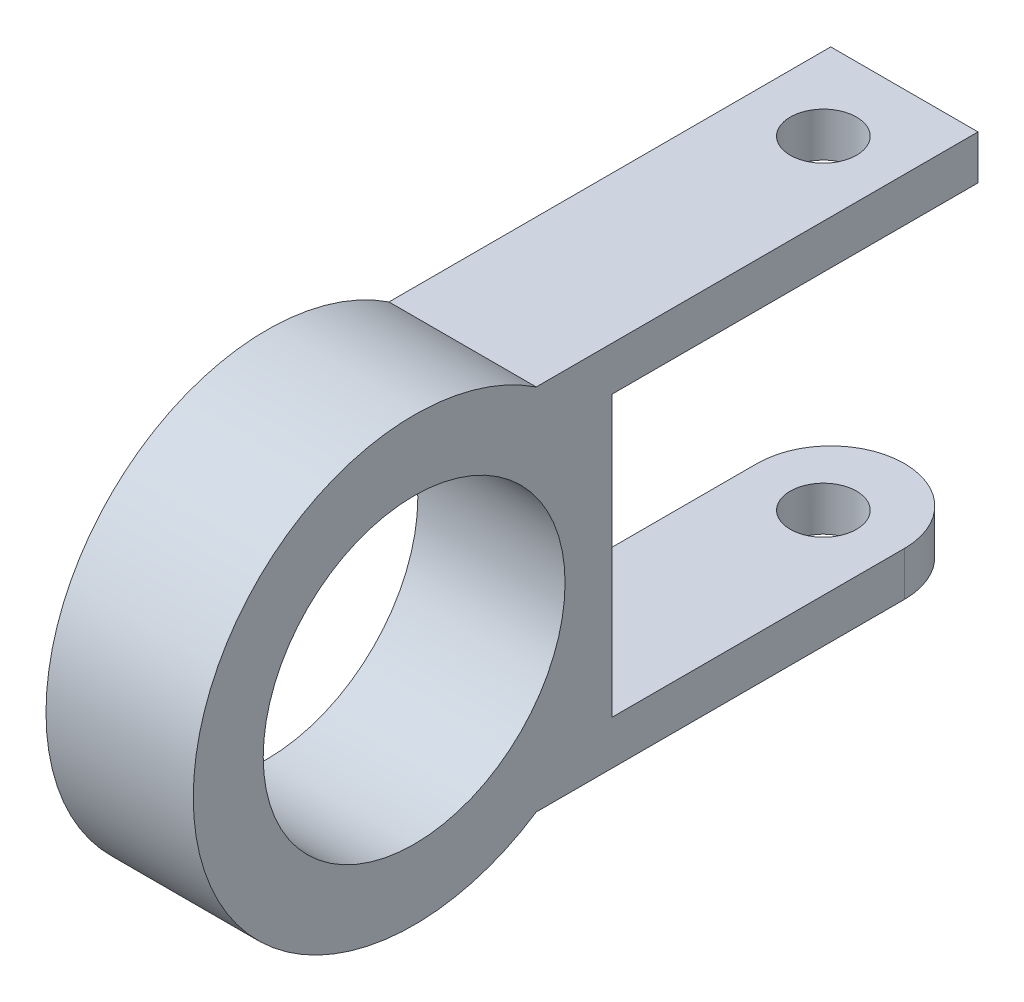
ISO-10303-21;
HEADER;
FILE_DESCRIPTION(('STEP AP214'),'2;1');
FILE_NAME('part.step','',(''),(''),'','','');
FILE_SCHEMA(('AUTOMOTIVE_DESIGN { 1 0 10303 214 1 1 1 1 }'));
ENDSEC;
DATA;
#1=APPLICATION_CONTEXT('core data for automotive mechanical design processes');
#2=APPLICATION_PROTOCOL_DEFINITION('international standard','automotive_design',2000,#1);
#3=PRODUCT_CONTEXT('',#1,'mechanical');
#4=PRODUCT('Part','Part','',(#3));
#5=PRODUCT_RELATED_PRODUCT_CATEGORY('part','',(#4));
#6=PRODUCT_DEFINITION_FORMATION('','',#4);
#7=PRODUCT_DEFINITION_CONTEXT('part definition',#1,'design');
#8=PRODUCT_DEFINITION('design','',#6,#7);
#9=PRODUCT_DEFINITION_SHAPE('','',#8);
#10=(LENGTH_UNIT() NAMED_UNIT(*) SI_UNIT(.MILLI.,.METRE.));
#11=(NAMED_UNIT(*) PLANE_ANGLE_UNIT() SI_UNIT($,.RADIAN.));
#12=(NAMED_UNIT(*) SI_UNIT($,.STERADIAN.) SOLID_ANGLE_UNIT());
#13=UNCERTAINTY_MEASURE_WITH_UNIT(LENGTH_MEASURE(1.E-05),#10,'distance_accuracy_value','');
#14=(GEOMETRIC_REPRESENTATION_CONTEXT(3) GLOBAL_UNCERTAINTY_ASSIGNED_CONTEXT((#13)) GLOBAL_UNIT_ASSIGNED_CONTEXT((#10,
#11,#12)) REPRESENTATION_CONTEXT('',''));
#15=CARTESIAN_POINT('',(0.,0.,0.));
#16=DIRECTION('',(0.,0.,1.));
#17=DIRECTION('',(1.,0.,0.));
#18=AXIS2_PLACEMENT_3D('',#15,#16,#17);
#19=CARTESIAN_POINT('',(5.,-9.5,-33.2915619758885));
#20=DIRECTION('',(0.,1.,0.));
#21=DIRECTION('',(0.,0.,1.));
#22=AXIS2_PLACEMENT_3D('',#19,#20,#21);
#23=CYLINDRICAL_SURFACE('',#22,5.);
#24=DIRECTION('',(0.,1.,0.));
#25=VECTOR('',#24,1.);
#26=CARTESIAN_POINT('',(0.,0.,-33.2915619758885));
#27=LINE('',#26,#25);
#28=CARTESIAN_POINT('',(0.,-9.5,-33.2915619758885));
#29=VERTEX_POINT('',#28);
#30=CARTESIAN_POINT('',(0.,-12.5,-33.2915619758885));
#31=VERTEX_POINT('',#30);
#32=EDGE_CURVE('E202',#29,#31,#27,.F.);
#33=ORIENTED_EDGE('',*,*,#32,.F.);
#34=CARTESIAN_POINT('',(5.,-9.5,-33.2915619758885));
#35=DIRECTION('',(0.,-1.,0.));
#36=DIRECTION('',(0.,0.,-1.));
#37=AXIS2_PLACEMENT_3D('',#34,#35,#36);
#38=CIRCLE('',#37,5.);
#39=CARTESIAN_POINT('',(10.,-9.5,-33.2915619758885));
#40=VERTEX_POINT('',#39);
#41=EDGE_CURVE('E54',#40,#29,#38,.F.);
#42=ORIENTED_EDGE('',*,*,#41,.F.);
#43=DIRECTION('',(0.,-1.,0.));
#44=VECTOR('',#43,1.);
#45=CARTESIAN_POINT('',(10.,-9.5,-33.2915619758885));
#46=LINE('',#45,#44);
#47=CARTESIAN_POINT('',(10.,-12.5,-33.2915619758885));
#48=VERTEX_POINT('',#47);
#49=EDGE_CURVE('E134',#48,#40,#46,.F.);
#50=ORIENTED_EDGE('',*,*,#49,.F.);
#51=CARTESIAN_POINT('',(5.,-12.5,-33.2915619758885));
#52=DIRECTION('',(0.,1.,0.));
#53=DIRECTION('',(0.,0.,1.));
#54=AXIS2_PLACEMENT_3D('',#51,#52,#53);
#55=CIRCLE('',#54,5.);
#56=EDGE_CURVE('E11',#31,#48,#55,.F.);
#57=ORIENTED_EDGE('',*,*,#56,.F.);
#58=EDGE_LOOP('',(#33,#42,#50,#57));
#59=FACE_BOUND('',#58,.T.);
#60=ADVANCED_FACE('F45',(#59),#23,.T.);
#61=CARTESIAN_POINT('',(10.,0.,-38.2915619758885));
#62=DIRECTION('',(0.,0.,1.));
#63=DIRECTION('',(1.,0.,0.));
#64=AXIS2_PLACEMENT_3D('',#61,#62,#63);
#65=PLANE('',#64);
#66=DIRECTION('',(0.,1.,0.));
#67=VECTOR('',#66,1.);
#68=CARTESIAN_POINT('',(10.,0.,-38.2915619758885));
#69=LINE('',#68,#67);
#70=CARTESIAN_POINT('',(10.,9.5,-38.2915619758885));
#71=VERTEX_POINT('',#70);
#72=CARTESIAN_POINT('',(10.,12.5,-38.2915619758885));
#73=VERTEX_POINT('',#72);
#74=EDGE_CURVE('E152',#71,#73,#69,.T.);
#75=ORIENTED_EDGE('',*,*,#74,.F.);
#76=DIRECTION('',(-1.,0.,0.));
#77=VECTOR('',#76,1.);
#78=CARTESIAN_POINT('',(10.,9.5,-38.2915619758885));
#79=LINE('',#78,#77);
#80=CARTESIAN_POINT('',(0.,9.5,-38.2915619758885));
#81=VERTEX_POINT('',#80);
#82=EDGE_CURVE('E143',#71,#81,#79,.T.);
#83=ORIENTED_EDGE('',*,*,#82,.T.);
#84=DIRECTION('',(0.,1.,0.));
#85=VECTOR('',#84,1.);
#86=CARTESIAN_POINT('',(0.,0.,-38.2915619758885));
#87=LINE('',#86,#85);
#88=CARTESIAN_POINT('',(0.,12.5,-38.2915619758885));
#89=VERTEX_POINT('',#88);
#90=EDGE_CURVE('E170',#81,#89,#87,.T.);
#91=ORIENTED_EDGE('',*,*,#90,.T.);
#92=DIRECTION('',(-1.,0.,0.));
#93=VECTOR('',#92,1.);
#94=CARTESIAN_POINT('',(10.,12.5,-38.2915619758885));
#95=LINE('',#94,#93);
#96=EDGE_CURVE('E189',#73,#89,#95,.T.);
#97=ORIENTED_EDGE('',*,*,#96,.F.);
#98=EDGE_LOOP('',(#75,#83,#91,#97));
#99=FACE_BOUND('',#98,.T.);
#100=ADVANCED_FACE('F225',(#99),#65,.F.);
#101=CARTESIAN_POINT('',(10.,0.,0.));
#102=DIRECTION('',(-1.,0.,0.));
#103=DIRECTION('',(0.,0.,1.));
#104=AXIS2_PLACEMENT_3D('',#101,#102,#103);
#105=CYLINDRICAL_SURFACE('',#104,10.25);
#106=CARTESIAN_POINT('',(0.,0.,0.));
#107=DIRECTION('',(1.,0.,0.));
#108=DIRECTION('',(0.,0.,-1.));
#109=AXIS2_PLACEMENT_3D('',#106,#107,#108);
#110=CIRCLE('',#109,10.25);
#111=CARTESIAN_POINT('',(0.,0.,-10.25));
#112=VERTEX_POINT('',#111);
#113=EDGE_CURVE('E153',#112,#112,#110,.T.);
#114=ORIENTED_EDGE('',*,*,#113,.F.);
#115=EDGE_LOOP('',(#114));
#116=FACE_BOUND('',#115,.T.);
#117=CARTESIAN_POINT('',(10.,0.,0.));
#118=DIRECTION('',(1.,0.,0.));
#119=DIRECTION('',(0.,0.,-1.));
#120=AXIS2_PLACEMENT_3D('',#117,#118,#119);
#121=CIRCLE('',#120,10.25);
#122=CARTESIAN_POINT('',(10.,0.,-10.25));
#123=VERTEX_POINT('',#122);
#124=EDGE_CURVE('E163',#123,#123,#121,.T.);
#125=ORIENTED_EDGE('',*,*,#124,.T.);
#126=EDGE_LOOP('',(#125));
#127=FACE_BOUND('',#126,.T.);
#128=ADVANCED_FACE('F236',(#116,#127),#105,.F.);
#129=CARTESIAN_POINT('',(10.,-12.5,0.));
#130=DIRECTION('',(0.,1.,0.));
#131=DIRECTION('',(0.,0.,1.));
#132=AXIS2_PLACEMENT_3D('',#129,#130,#131);
#133=PLANE('',#132);
#134=CARTESIAN_POINT('',(5.,-12.5,-32.7915619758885));
#135=DIRECTION('',(0.,1.,0.));
#136=DIRECTION('',(0.,0.,1.));
#137=AXIS2_PLACEMENT_3D('',#134,#135,#136);
#138=CIRCLE('',#137,2.25);
#139=CARTESIAN_POINT('',(5.,-12.5,-30.5415619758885));
#140=VERTEX_POINT('',#139);
#141=EDGE_CURVE('E130',#140,#140,#138,.F.);
#142=ORIENTED_EDGE('',*,*,#141,.F.);
#143=EDGE_LOOP('',(#142));
#144=FACE_BOUND('',#143,.T.);
#145=DIRECTION('',(0.,0.,-1.));
#146=VECTOR('',#145,1.);
#147=CARTESIAN_POINT('',(0.,-12.5,0.));
#148=LINE('',#147,#146);
#149=CARTESIAN_POINT('',(0.,-12.5,-8.2915619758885));
#150=VERTEX_POINT('',#149);
#151=EDGE_CURVE('E148',#150,#31,#148,.T.);
#152=ORIENTED_EDGE('',*,*,#151,.T.);
#153=ORIENTED_EDGE('',*,*,#56,.T.);
#154=DIRECTION('',(0.,0.,-1.));
#155=VECTOR('',#154,1.);
#156=CARTESIAN_POINT('',(10.,-12.5,0.));
#157=LINE('',#156,#155);
#158=CARTESIAN_POINT('',(10.,-12.5,-8.2915619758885));
#159=VERTEX_POINT('',#158);
#160=EDGE_CURVE('E149',#159,#48,#157,.T.);
#161=ORIENTED_EDGE('',*,*,#160,.F.);
#162=DIRECTION('',(-1.,0.,0.));
#163=VECTOR('',#162,1.);
#164=CARTESIAN_POINT('',(10.,-12.5,-8.2915619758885));
#165=LINE('',#164,#163);
#166=EDGE_CURVE('E167',#159,#150,#165,.T.);
#167=ORIENTED_EDGE('',*,*,#166,.T.);
#168=EDGE_LOOP('',(#152,#153,#161,#167));
#169=FACE_BOUND('',#168,.T.);
#170=ADVANCED_FACE('F234',(#144,#169),#133,.F.);
#171=CARTESIAN_POINT('',(10.,12.5,0.));
#172=DIRECTION('',(0.,1.,0.));
#173=DIRECTION('',(0.,0.,1.));
#174=AXIS2_PLACEMENT_3D('',#171,#172,#173);
#175=PLANE('',#174);
#176=CARTESIAN_POINT('',(5.,12.5,-32.7915619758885));
#177=DIRECTION('',(0.,1.,0.));
#178=DIRECTION('',(0.,0.,1.));
#179=AXIS2_PLACEMENT_3D('',#176,#177,#178);
#180=CIRCLE('',#179,2.25);
#181=CARTESIAN_POINT('',(5.,12.5,-30.5415619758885));
#182=VERTEX_POINT('',#181);
#183=EDGE_CURVE('E283',#182,#182,#180,.F.);
#184=ORIENTED_EDGE('',*,*,#183,.T.);
#185=EDGE_LOOP('',(#184));
#186=FACE_BOUND('',#185,.T.);
#187=DIRECTION('',(0.,0.,-1.));
#188=VECTOR('',#187,1.);
#189=CARTESIAN_POINT('',(0.,12.5,0.));
#190=LINE('',#189,#188);
#191=CARTESIAN_POINT('',(0.,12.5,-8.2915619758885));
#192=VERTEX_POINT('',#191);
#193=EDGE_CURVE('E173',#192,#89,#190,.T.);
#194=ORIENTED_EDGE('',*,*,#193,.F.);
#195=DIRECTION('',(-1.,0.,0.));
#196=VECTOR('',#195,1.);
#197=CARTESIAN_POINT('',(10.,12.5,-8.2915619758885));
#198=LINE('',#197,#196);
#199=CARTESIAN_POINT('',(10.,12.5,-8.2915619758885));
#200=VERTEX_POINT('',#199);
#201=EDGE_CURVE('E186',#200,#192,#198,.T.);
#202=ORIENTED_EDGE('',*,*,#201,.F.);
#203=DIRECTION('',(0.,0.,-1.));
#204=VECTOR('',#203,1.);
#205=CARTESIAN_POINT('',(10.,12.5,0.));
#206=LINE('',#205,#204);
#207=EDGE_CURVE('E156',#200,#73,#206,.T.);
#208=ORIENTED_EDGE('',*,*,#207,.T.);
#209=ORIENTED_EDGE('',*,*,#96,.T.);
#210=EDGE_LOOP('',(#194,#202,#208,#209));
#211=FACE_BOUND('',#210,.T.);
#212=ADVANCED_FACE('F228',(#186,#211),#175,.T.);
#213=CARTESIAN_POINT('',(10.,0.,0.));
#214=DIRECTION('',(-1.,0.,0.));
#215=DIRECTION('',(0.,0.,1.));
#216=AXIS2_PLACEMENT_3D('',#213,#214,#215);
#217=CYLINDRICAL_SURFACE('',#216,15.);
#218=CARTESIAN_POINT('',(0.,0.,0.));
#219=DIRECTION('',(1.,0.,0.));
#220=DIRECTION('',(0.,0.,-1.));
#221=AXIS2_PLACEMENT_3D('',#218,#219,#220);
#222=CIRCLE('',#221,15.);
#223=EDGE_CURVE('E177',#192,#150,#222,.T.);
#224=ORIENTED_EDGE('',*,*,#223,.T.);
#225=ORIENTED_EDGE('',*,*,#166,.F.);
#226=CARTESIAN_POINT('',(10.,0.,0.));
#227=DIRECTION('',(1.,0.,0.));
#228=DIRECTION('',(0.,0.,-1.));
#229=AXIS2_PLACEMENT_3D('',#226,#227,#228);
#230=CIRCLE('',#229,15.);
#231=EDGE_CURVE('E160',#200,#159,#230,.T.);
#232=ORIENTED_EDGE('',*,*,#231,.F.);
#233=ORIENTED_EDGE('',*,*,#201,.T.);
#234=EDGE_LOOP('',(#224,#225,#232,#233));
#235=FACE_BOUND('',#234,.T.);
#236=ADVANCED_FACE('F232',(#235),#217,.T.);
#237=CARTESIAN_POINT('',(10.,0.,0.));
#238=DIRECTION('',(1.,0.,0.));
#239=DIRECTION('',(0.,0.,-1.));
#240=AXIS2_PLACEMENT_3D('',#237,#238,#239);
#241=PLANE('',#240);
#242=ORIENTED_EDGE('',*,*,#124,.F.);
#243=EDGE_LOOP('',(#242));
#244=FACE_BOUND('',#243,.T.);
#245=ORIENTED_EDGE('',*,*,#160,.T.);
#246=ORIENTED_EDGE('',*,*,#49,.T.);
#247=DIRECTION('',(0.,0.,-1.));
#248=VECTOR('',#247,1.);
#249=CARTESIAN_POINT('',(10.,-9.5,-13.447806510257));
#250=LINE('',#249,#248);
#251=CARTESIAN_POINT('',(10.,-9.5,-13.447806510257));
#252=VERTEX_POINT('',#251);
#253=EDGE_CURVE('E113',#252,#40,#250,.T.);
#254=ORIENTED_EDGE('',*,*,#253,.F.);
#255=DIRECTION('',(0.,-1.,0.));
#256=VECTOR('',#255,1.);
#257=CARTESIAN_POINT('',(10.,9.5,-13.447806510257));
#258=LINE('',#257,#256);
#259=CARTESIAN_POINT('',(10.,9.5,-13.447806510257));
#260=VERTEX_POINT('',#259);
#261=EDGE_CURVE('E123',#260,#252,#258,.T.);
#262=ORIENTED_EDGE('',*,*,#261,.F.);
#263=DIRECTION('',(0.,0.,1.));
#264=VECTOR('',#263,1.);
#265=CARTESIAN_POINT('',(10.,9.5,-13.447806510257));
#266=LINE('',#265,#264);
#267=EDGE_CURVE('E120',#71,#260,#266,.T.);
#268=ORIENTED_EDGE('',*,*,#267,.F.);
#269=ORIENTED_EDGE('',*,*,#74,.T.);
#270=ORIENTED_EDGE('',*,*,#207,.F.);
#271=ORIENTED_EDGE('',*,*,#231,.T.);
#272=EDGE_LOOP('',(#245,#246,#254,#262,#268,#269,#270,#271));
#273=FACE_BOUND('',#272,.T.);
#274=ADVANCED_FACE('F133',(#244,#273),#241,.T.);
#275=CARTESIAN_POINT('',(0.,0.,0.));
#276=DIRECTION('',(1.,0.,0.));
#277=DIRECTION('',(0.,0.,-1.));
#278=AXIS2_PLACEMENT_3D('',#275,#276,#277);
#279=PLANE('',#278);
#280=DIRECTION('',(0.,0.,-1.));
#281=VECTOR('',#280,1.);
#282=CARTESIAN_POINT('',(0.,-9.5,0.));
#283=LINE('',#282,#281);
#284=CARTESIAN_POINT('',(0.,-9.5,-13.447806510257));
#285=VERTEX_POINT('',#284);
#286=EDGE_CURVE('E115',#285,#29,#283,.T.);
#287=ORIENTED_EDGE('',*,*,#286,.T.);
#288=ORIENTED_EDGE('',*,*,#32,.T.);
#289=ORIENTED_EDGE('',*,*,#151,.F.);
#290=ORIENTED_EDGE('',*,*,#223,.F.);
#291=ORIENTED_EDGE('',*,*,#193,.T.);
#292=ORIENTED_EDGE('',*,*,#90,.F.);
#293=DIRECTION('',(0.,0.,1.));
#294=VECTOR('',#293,1.);
#295=CARTESIAN_POINT('',(0.,9.5,0.));
#296=LINE('',#295,#294);
#297=CARTESIAN_POINT('',(0.,9.5,-13.447806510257));
#298=VERTEX_POINT('',#297);
#299=EDGE_CURVE('E198',#81,#298,#296,.T.);
#300=ORIENTED_EDGE('',*,*,#299,.T.);
#301=DIRECTION('',(0.,-1.,0.));
#302=VECTOR('',#301,1.);
#303=CARTESIAN_POINT('',(0.,0.,-13.447806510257));
#304=LINE('',#303,#302);
#305=EDGE_CURVE('E195',#298,#285,#304,.T.);
#306=ORIENTED_EDGE('',*,*,#305,.T.);
#307=EDGE_LOOP('',(#287,#288,#289,#290,#291,#292,#300,#306));
#308=FACE_BOUND('',#307,.T.);
#309=ORIENTED_EDGE('',*,*,#113,.T.);
#310=EDGE_LOOP('',(#309));
#311=FACE_BOUND('',#310,.T.);
#312=ADVANCED_FACE('F216',(#308,#311),#279,.F.);
#313=CARTESIAN_POINT('',(-13.,9.5,-13.447806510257));
#314=DIRECTION('',(0.,0.,1.));
#315=DIRECTION('',(0.,-1.,0.));
#316=AXIS2_PLACEMENT_3D('',#313,#314,#315);
#317=PLANE('',#316);
#318=DIRECTION('',(1.,0.,0.));
#319=VECTOR('',#318,1.);
#320=CARTESIAN_POINT('',(-13.,9.5,-13.447806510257));
#321=LINE('',#320,#319);
#322=EDGE_CURVE('E119',#298,#260,#321,.T.);
#323=ORIENTED_EDGE('',*,*,#322,.T.);
#324=ORIENTED_EDGE('',*,*,#261,.T.);
#325=DIRECTION('',(1.,0.,0.));
#326=VECTOR('',#325,1.);
#327=CARTESIAN_POINT('',(-13.,-9.5,-13.447806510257));
#328=LINE('',#327,#326);
#329=EDGE_CURVE('E109',#285,#252,#328,.T.);
#330=ORIENTED_EDGE('',*,*,#329,.F.);
#331=ORIENTED_EDGE('',*,*,#305,.F.);
#332=EDGE_LOOP('',(#323,#324,#330,#331));
#333=FACE_BOUND('',#332,.T.);
#334=ADVANCED_FACE('F124',(#333),#317,.F.);
#335=CARTESIAN_POINT('',(-13.,9.5,-13.447806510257));
#336=DIRECTION('',(0.,1.,0.));
#337=DIRECTION('',(0.,0.,1.));
#338=AXIS2_PLACEMENT_3D('',#335,#336,#337);
#339=PLANE('',#338);
#340=CARTESIAN_POINT('',(5.,9.50000000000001,-32.7915619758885));
#341=DIRECTION('',(0.,1.,0.));
#342=DIRECTION('',(0.,0.,1.));
#343=AXIS2_PLACEMENT_3D('',#340,#341,#342);
#344=CIRCLE('',#343,2.25);
#345=CARTESIAN_POINT('',(5.,9.50000000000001,-30.5415619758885));
#346=VERTEX_POINT('',#345);
#347=EDGE_CURVE('E207',#346,#346,#344,.F.);
#348=ORIENTED_EDGE('',*,*,#347,.F.);
#349=EDGE_LOOP('',(#348));
#350=FACE_BOUND('',#349,.T.);
#351=ORIENTED_EDGE('',*,*,#267,.T.);
#352=ORIENTED_EDGE('',*,*,#322,.F.);
#353=ORIENTED_EDGE('',*,*,#299,.F.);
#354=ORIENTED_EDGE('',*,*,#82,.F.);
#355=EDGE_LOOP('',(#351,#352,#353,#354));
#356=FACE_BOUND('',#355,.T.);
#357=ADVANCED_FACE('F220',(#350,#356),#339,.F.);
#358=CARTESIAN_POINT('',(-13.,-9.5,-13.447806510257));
#359=DIRECTION('',(0.,-1.,0.));
#360=DIRECTION('',(0.,0.,-1.));
#361=AXIS2_PLACEMENT_3D('',#358,#359,#360);
#362=PLANE('',#361);
#363=CARTESIAN_POINT('',(5.,-9.5,-32.7915619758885));
#364=DIRECTION('',(0.,-1.,0.));
#365=DIRECTION('',(0.,0.,-1.));
#366=AXIS2_PLACEMENT_3D('',#363,#364,#365);
#367=CIRCLE('',#366,2.25);
#368=CARTESIAN_POINT('',(5.,-9.5,-35.0415619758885));
#369=VERTEX_POINT('',#368);
#370=EDGE_CURVE('E203',#369,#369,#367,.F.);
#371=ORIENTED_EDGE('',*,*,#370,.F.);
#372=EDGE_LOOP('',(#371));
#373=FACE_BOUND('',#372,.T.);
#374=ORIENTED_EDGE('',*,*,#253,.T.);
#375=ORIENTED_EDGE('',*,*,#41,.T.);
#376=ORIENTED_EDGE('',*,*,#286,.F.);
#377=ORIENTED_EDGE('',*,*,#329,.T.);
#378=EDGE_LOOP('',(#374,#375,#376,#377));
#379=FACE_BOUND('',#378,.T.);
#380=ADVANCED_FACE('F111',(#373,#379),#362,.F.);
#381=CARTESIAN_POINT('',(5.,-30.5,-32.7915619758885));
#382=DIRECTION('',(0.,1.,0.));
#383=DIRECTION('',(0.,0.,1.));
#384=AXIS2_PLACEMENT_3D('',#381,#382,#383);
#385=CYLINDRICAL_SURFACE('',#384,2.25);
#386=ORIENTED_EDGE('',*,*,#370,.T.);
#387=EDGE_LOOP('',(#386));
#388=FACE_BOUND('',#387,.T.);
#389=ORIENTED_EDGE('',*,*,#141,.T.);
#390=EDGE_LOOP('',(#389));
#391=FACE_BOUND('',#390,.T.);
#392=ADVANCED_FACE('F267',(#388,#391),#385,.F.);
#393=ORIENTED_EDGE('',*,*,#183,.F.);
#394=EDGE_LOOP('',(#393));
#395=FACE_BOUND('',#394,.T.);
#396=ORIENTED_EDGE('',*,*,#347,.T.);
#397=EDGE_LOOP('',(#396));
#398=FACE_BOUND('',#397,.T.);
#399=ADVANCED_FACE('F273',(#395,#398),#385,.F.);
#400=CLOSED_SHELL('',(#60,#100,#128,#170,#212,#236,#274,#312,#334,#357,#380,#392,#399));
#401=MANIFOLD_SOLID_BREP('B2',#400);
#402=ADVANCED_BREP_SHAPE_REPRESENTATION('',(#18,#401),#14);
#403=SHAPE_DEFINITION_REPRESENTATION(#9,#402);
ENDSEC;
END-ISO-10303-21;
